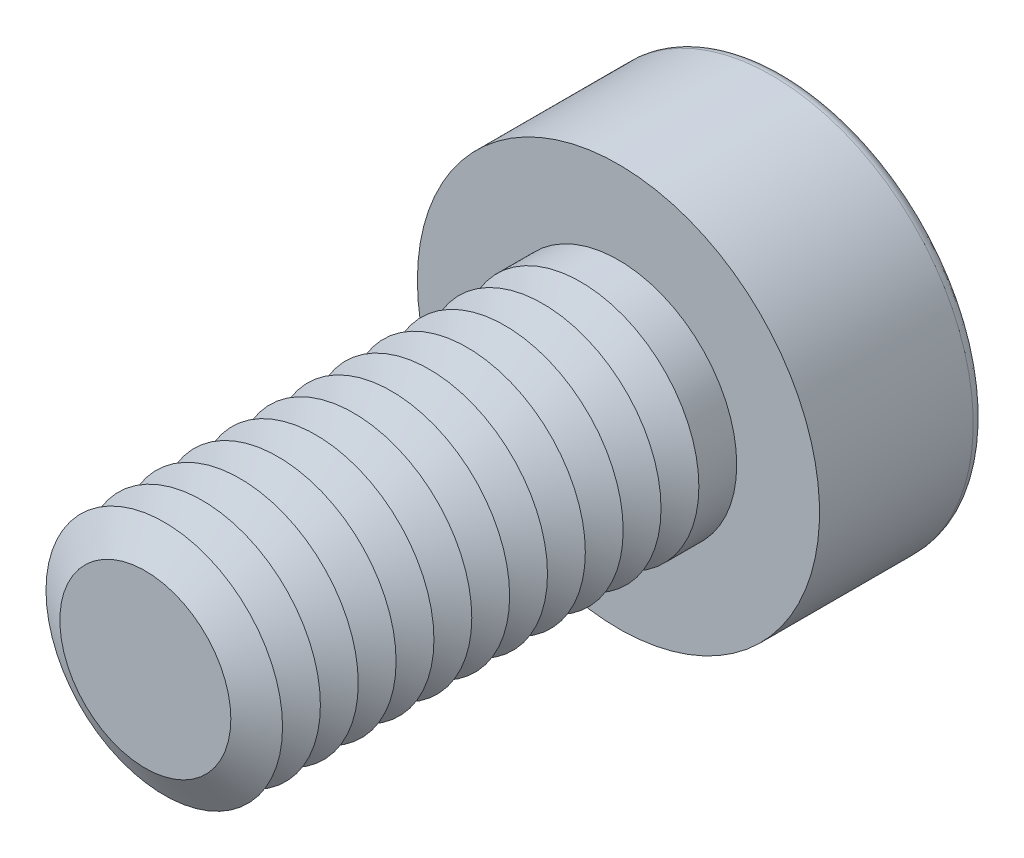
from build123d import *

# Parameters (mm, degrees)
SKETCH1_R           = 2.5
BOSS_EXTRUDE1_DEPTH = 10
SKETCH2_R           = 4.25
BOSS_EXTRUDE2_DEPTH = 3.5
CUT_EXTRUDE1_DEPTH  = 2.25
FILLET1_R           = 0.25
LPATTERN1_COUNT     = 12
LPATTERN1_PITCH     = 0.8


with BuildPart() as part:
    # Sketch1 → Boss-Extrude1 (new body)
    with BuildSketch(Plane.XY):
        Circle(SKETCH1_R)
    extrude(amount=BOSS_EXTRUDE1_DEPTH)

    # Sketch2 → Boss-Extrude2 (add)
    with BuildSketch(Plane(origin=(0, 0, 0), x_dir=(-1, 0, 0), z_dir=(0, 0, -1))):
        Circle(SKETCH2_R)
    extrude(amount=BOSS_EXTRUDE2_DEPTH)

    # Sketch3 → Cut-Extrude1 (cut)
    with BuildSketch(Plane(origin=(0, 0, -3.5), x_dir=(-1, 0, 0), z_dir=(0, 0, -1))):
        Polygon((-0.866025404, 1.5), (-1.732050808, 0), (-0.866025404, -1.5), (0.866025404, -1.5), (1.732050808, 0), (0.866025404, 1.5), align=None)
    extrude(amount=-CUT_EXTRUDE1_DEPTH, mode=Mode.SUBTRACT)

    # Fillet1
    fillet1_edges = [part.edges().sort_by_distance(p)[0] for p in [
        (4.25, 0, -3.5),
    ]]
    fillet(fillet1_edges, radius=FILLET1_R)

    # Cut-Extrude2 cone 1 section (on through the dimple's axis) → Cut-Extrude2 (revolve, cut)
    with BuildSketch(Plane(origin=(0, 0, -1.25), x_dir=(0, 1, 0), z_dir=(1, 0, 0))):
        Polygon((0, 0), (1.5, 0), (0, 0.866025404), align=None)
    revolve(axis=Axis((0, 0, -1.25), (0, 0, 1)), mode=Mode.SUBTRACT)

    # Cut-Extrude3 cone 1 section (on through the dimple's axis) → Cut-Extrude3 (revolve, cut)
    with BuildSketch(Plane(origin=(0, 0, -3.5), x_dir=(0, 1, 0), z_dir=(1, 0, 0))):
        Polygon((0, 0), (1.732050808, 0), (0, 0.464101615), align=None)
    revolve(axis=Axis((0, 0, -3.5), (0, 0, 1)), mode=Mode.SUBTRACT)

    # Sketch7 → Cut-Revolve1 (revolve, cut)
    with BuildSketch(Plane(origin=(0, 0, 0), x_dir=(0, 0, -1), z_dir=(1, 0, 0)), mode=Mode.PRIVATE) as cut_revolve1_sk:
        Polygon((-10, 1.807179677), (-9.6, 2.5), (-10.4, 2.5), align=None)
    cut_revolve1 = revolve(cut_revolve1_sk.sketch.rotate(Axis((0, 0, 10), (0, 0, -1)), 90), axis=Axis((0, 0, 10), (0, 0, -1)), mode=Mode.SUBTRACT)

    # LPattern1: Cut-Revolve1 ×12
    with Locations(*[(0, 0, -i * LPATTERN1_PITCH) for i in range(1, LPATTERN1_COUNT)]):
        add(cut_revolve1, mode=Mode.SUBTRACT)


solid = part.part
